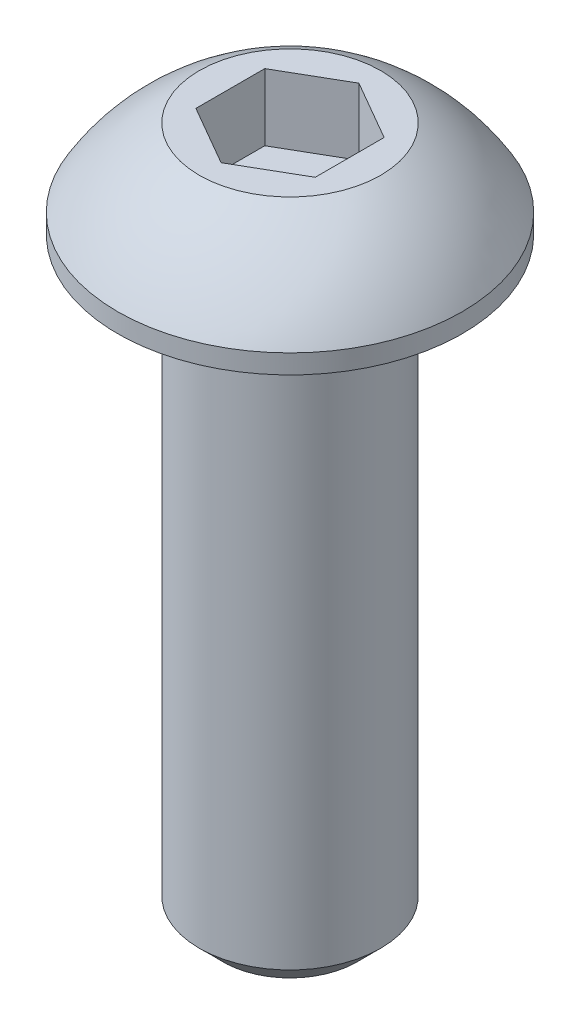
from build123d import *

# Parameters (mm, degrees)
CUT_EXTRUDE1_DEPTH = 1.778


with BuildPart() as part:
    # Sketch1 → Base-Revolve (revolve)
    with BuildSketch(Plane.XY, mode=Mode.PRIVATE) as base_revolve_sk:
        with BuildLine():
            Line((0, 0), (4.5847, 0))
            Line((4.5847, 0), (4.5847, 0.508))
            ThreePointArc((4.5847, 0.508), (3.6469405, 1.69301775), (2.413, 2.5654))
            Line((2.413, 2.5654), (0, 2.5654))
            Line((0, 2.5654), (0, 0))
        make_face()
    revolve(base_revolve_sk.sketch.rotate(Axis((0, 0, 0), (0, 1, 0)), 90), axis=Axis((0, 0, 0), (0, 1, 0)))

    # Sketch2 → Boss-Revolve1 (revolve)
    with BuildSketch(Plane.XY, mode=Mode.PRIVATE) as boss_revolve1_sk:
        Polygon((0, -15.875), (1.78308, -15.875), (2.413, -15.24508), (2.413, 0), (0, 0), align=None)
    revolve(boss_revolve1_sk.sketch.rotate(Axis((0, 0, 0), (0, 1, 0)), 90), axis=Axis((0, 0, 0), (0, 1, 0)))

    # Sketch3 → Cut-Extrude1 (cut)
    with BuildSketch(Plane(origin=(0, 2.5654, 0), x_dir=(-1, 0, 0), z_dir=(0, 1, 0))):
        Polygon((1.5875, 0.916543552), (0, 1.833087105), (-1.5875, 0.916543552), (-1.5875, -0.916543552), (0, -1.833087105), (1.5875, -0.916543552), align=None)
    extrude(amount=-CUT_EXTRUDE1_DEPTH, mode=Mode.SUBTRACT)


solid = part.part
